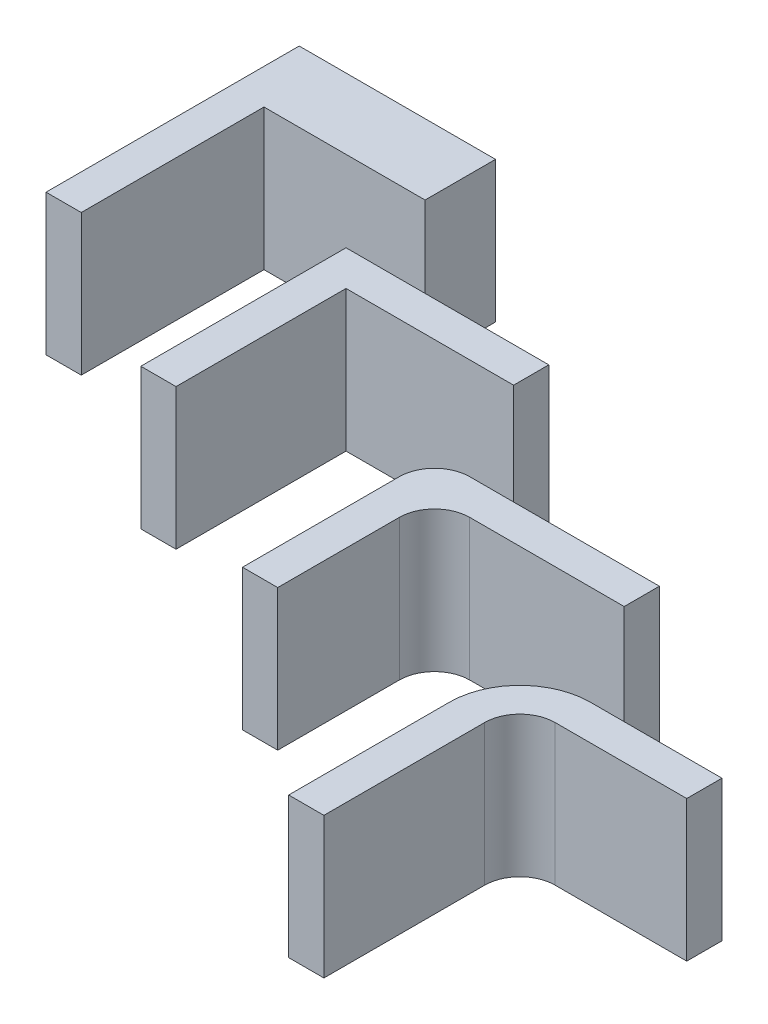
from build123d import *

# Parameters (mm, degrees)
BOSS_EXTRUDE1_DEPTH   = 20
BOSS_EXTRUDE1_2_DEPTH = 20
BOSS_EXTRUDE1_3_DEPTH = 20
FILLET1_R             = 5
BOSS_EXTRUDE2_DEPTH   = 20


with BuildPart() as part:
    # Sketch1 → Boss-Extrude1 (new body)
    with BuildSketch(Plane(origin=(0, 0, 0), x_dir=(1, 0, 0), z_dir=(0, 1, 0))):
        Polygon((0, 0), (0, 35.942292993), (27.867242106, 35.942292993), (27.867242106, 25.942292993), (5, 25.942292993), (5, 0), align=None)
    extrude(amount=BOSS_EXTRUDE1_DEPTH)


with BuildPart() as body_2:
    # Sketch1 → Boss-Extrude1 2 (new body)
    with BuildSketch(Plane(origin=(0, 0, 0), x_dir=(1, 0, 0), z_dir=(0, 1, 0))):
        Polygon((28.128929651, -14.673075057), (28.128929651, 14.459589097), (56.914559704, 14.459589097), (56.914559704, 9.459589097), (33.128929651, 9.459589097), (33.128929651, -14.673075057), align=None)
    extrude(amount=BOSS_EXTRUDE1_2_DEPTH)


with BuildPart() as body_3:
    # Sketch1 → Boss-Extrude1 3 (new body)
    with BuildSketch(Plane(origin=(0, 0, 0), x_dir=(1, 0, 0), z_dir=(0, 1, 0))):
        Polygon((91.980690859, -4.905289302), (60.054810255, -4.905289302), (60.054810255, -32.163727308), (65.054810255, -32.163727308), (65.054810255, -9.905289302), (91.980690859, -9.905289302), align=None)
    extrude(amount=BOSS_EXTRUDE1_3_DEPTH)

    # Fillet1
    fillet1_edges = [body_3.edges().sort_by_distance(p)[0] for p in [
        (65.054810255, 10, 9.905289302),
        (60.054810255, 10, 4.905289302),
    ]]
    fillet(fillet1_edges, radius=FILLET1_R)


with BuildPart() as body_4:
    # Sketch2 → Boss-Extrude2 (new body)
    with BuildSketch(Plane(origin=(0, 0, 0), x_dir=(1, 0, 0), z_dir=(0, 1, 0))):
        with BuildLine():
            Line((120.023845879, -24.067225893), (101.336441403, -24.067225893))
            ThreePointArc((101.336441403, -24.067225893), (94.265373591, -26.996158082), (91.336441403, -34.067225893))
            Line((91.336441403, -34.067225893), (91.336441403, -56.889715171))
            Line((91.336441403, -56.889715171), (96.336441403, -56.889715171))
            Line((96.336441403, -56.889715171), (96.336441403, -34.067225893))
            ThreePointArc((96.336441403, -34.067225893), (97.800907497, -30.531691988), (101.336441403, -29.067225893))
            Line((101.336441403, -29.067225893), (120.023845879, -29.067225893))
            Line((120.023845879, -29.067225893), (120.023845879, -24.067225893))
        make_face()
    extrude(amount=BOSS_EXTRUDE2_DEPTH)


solid = Compound([part.part, body_2.part, body_3.part, body_4.part])
